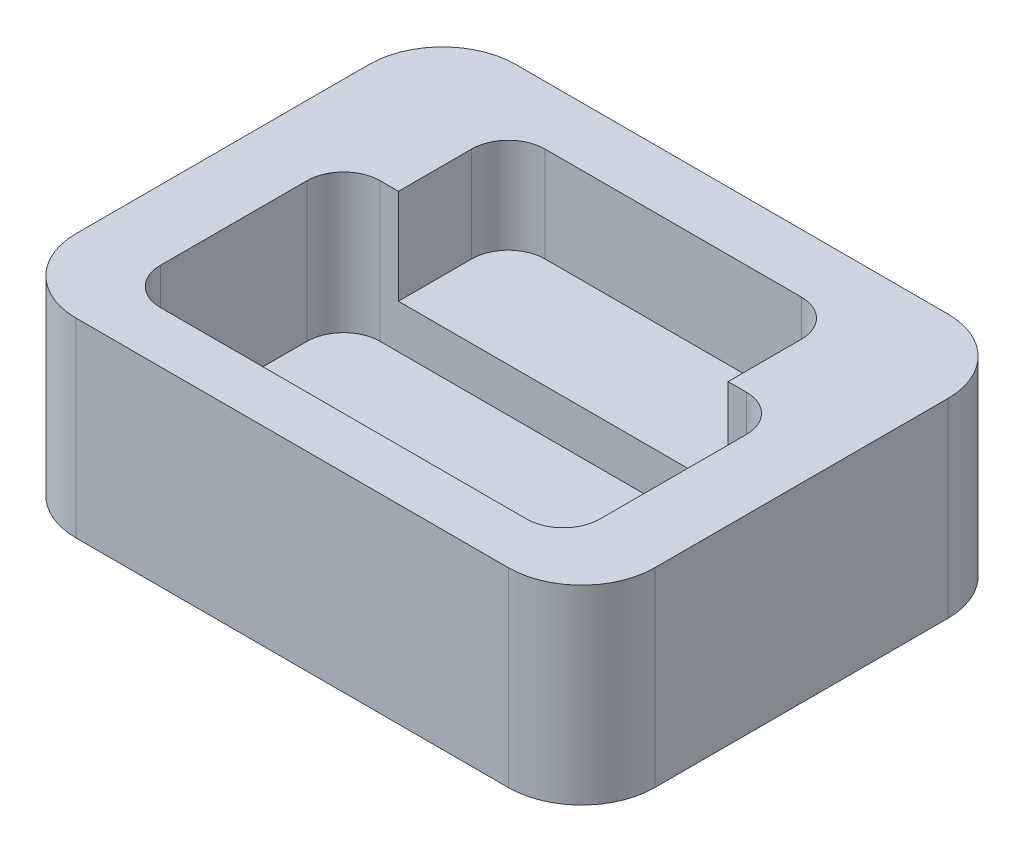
from build123d import *

# Parameters (mm, degrees)
EXTRUDE_1_DEPTH     = 26
CUT_EXTRUDE_1_DEPTH = 15
CUT_EXTRUDE_2_DEPTH = 13
CUT_EXTRUDE_5_DEPTH = 19


with BuildPart() as part:
    # Sketch 1 → Extrude 1 (new body)
    with BuildSketch(Plane(origin=(0, 0, 0), x_dir=(1, 0, 0), z_dir=(0, 1, 0))):
        with BuildLine():
            ThreePointArc((-36.372007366, 5.05801105), (-33.443075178, 12.129078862), (-26.372007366, 15.05801105))
            Line((-26.372007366, 15.05801105), (32.627992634, 15.05801105))
            ThreePointArc((32.627992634, 15.05801105), (39.699060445, 12.129078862), (42.627992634, 5.05801105))
            Line((42.627992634, 5.05801105), (42.627992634, -34.94198895))
            ThreePointArc((42.627992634, -34.94198895), (39.699060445, -42.013056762), (32.627992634, -44.94198895))
            Line((32.627992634, -44.94198895), (-26.372007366, -44.94198895))
            ThreePointArc((-26.372007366, -44.94198895), (-33.443075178, -42.013056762), (-36.372007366, -34.94198895))
            Line((-36.372007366, -34.94198895), (-36.372007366, 5.05801105))
        make_face()
    extrude(amount=EXTRUDE_1_DEPTH)

    # Sketch 2 → Cut-Extrude 1 (cut)
    with BuildSketch(Plane(origin=(0, 26, 0), x_dir=(1, 0, 0), z_dir=(0, 1, 0))):
        with BuildLine():
            Line((28.127992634, -37.94198895), (-21.872007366, -37.94198895))
            ThreePointArc((-21.872007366, -37.94198895), (-25.407541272, -36.477522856), (-26.872007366, -32.94198895))
            Line((-26.872007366, -32.94198895), (-26.872007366, -12.94198895))
            ThreePointArc((-26.872007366, -12.94198895), (-25.407541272, -9.406455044), (-21.872007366, -7.94198895))
            Line((-21.872007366, -7.94198895), (28.127992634, -7.94198895))
            ThreePointArc((28.127992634, -7.94198895), (31.663526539, -9.406455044), (33.127992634, -12.94198895))
            Line((33.127992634, -12.94198895), (33.127992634, -32.94198895))
            ThreePointArc((33.127992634, -32.94198895), (31.663526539, -36.477522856), (28.127992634, -37.94198895))
        make_face()
    extrude(amount=-CUT_EXTRUDE_1_DEPTH, mode=Mode.SUBTRACT)

    # Sketch 2_5 → Cut-Extrude 2 (cut)
    with BuildSketch(Plane(origin=(0, 26, 0), x_dir=(1, 0, 0), z_dir=(0, 1, 0))):
        with BuildLine():
            Line((-19.372007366, -7.94198895), (25.627992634, -7.94198895))
            Line((25.627992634, -7.94198895), (25.627992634, 2.05801105))
            ThreePointArc((25.627992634, 2.05801105), (24.163526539, 5.593544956), (20.627992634, 7.05801105))
            Line((20.627992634, 7.05801105), (-14.372007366, 7.05801105))
            ThreePointArc((-14.372007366, 7.05801105), (-17.907541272, 5.593544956), (-19.372007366, 2.05801105))
            Line((-19.372007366, 2.05801105), (-19.372007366, -7.94198895))
        make_face()
    extrude(amount=-CUT_EXTRUDE_2_DEPTH, mode=Mode.SUBTRACT)

    # Sketch 2_10 → Cut-Extrude 5 (cut)
    with BuildSketch(Plane(origin=(0, 26, 0), x_dir=(1, 0, 0), z_dir=(0, 1, 0))):
        with BuildLine():
            Line((28.127992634, -37.94198895), (-21.872007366, -37.94198895))
            ThreePointArc((-21.872007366, -37.94198895), (-25.407541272, -36.477522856), (-26.872007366, -32.94198895))
            Line((-26.872007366, -32.94198895), (-26.872007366, -12.94198895))
            ThreePointArc((-26.872007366, -12.94198895), (-25.407541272, -9.406455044), (-21.872007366, -7.94198895))
            Line((-21.872007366, -7.94198895), (28.127992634, -7.94198895))
            ThreePointArc((28.127992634, -7.94198895), (31.663526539, -9.406455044), (33.127992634, -12.94198895))
            Line((33.127992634, -12.94198895), (33.127992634, -32.94198895))
            ThreePointArc((33.127992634, -32.94198895), (31.663526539, -36.477522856), (28.127992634, -37.94198895))
        make_face()
    extrude(amount=-CUT_EXTRUDE_5_DEPTH, mode=Mode.SUBTRACT)


solid = part.part
